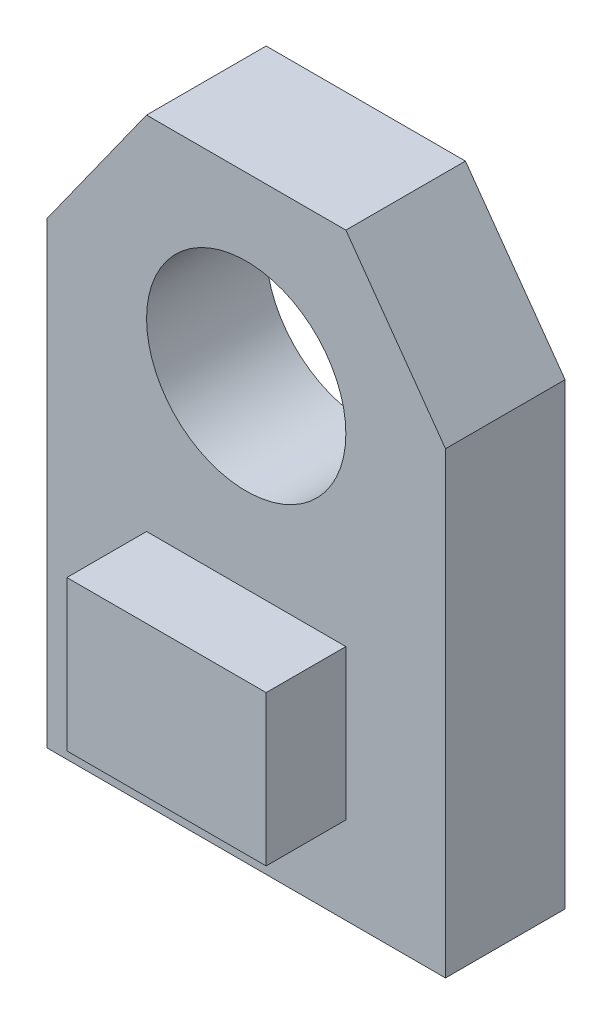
from build123d import *

# Parameters (mm, degrees)
EXTRUDE_1_DEPTH     = 12
SKETCH_2_R          = 10
CUT_EXTRUDE_1_DEPTH = 22
SKETCH_3_W          = 20
SKETCH_3_H          = 15.067909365
EXTRUDE_2_DEPTH     = 8


with BuildPart() as part:
    # Sketch 1 → Extrude 1 (new body)
    with BuildSketch(Plane.XY):
        Polygon((10, 60), (-10, 60), (-20, 46), (-20, 0), (20, 0), (20, 46), align=None)
    extrude(amount=EXTRUDE_1_DEPTH)

    # Sketch 2 → Cut-Extrude 1 (cut)
    with BuildSketch(Plane.XY.offset(12)):
        with Locations((0, 42.311460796)):
            Circle(SKETCH_2_R)
    extrude(amount=-CUT_EXTRUDE_1_DEPTH, mode=Mode.SUBTRACT)

    # Sketch 3 → Extrude 2 (add)
    with BuildSketch(Plane.XY.offset(12)):
        with Locations((0, 16.27128186)):
            Rectangle(SKETCH_3_W, SKETCH_3_H)
    extrude(amount=EXTRUDE_2_DEPTH)


solid = part.part
